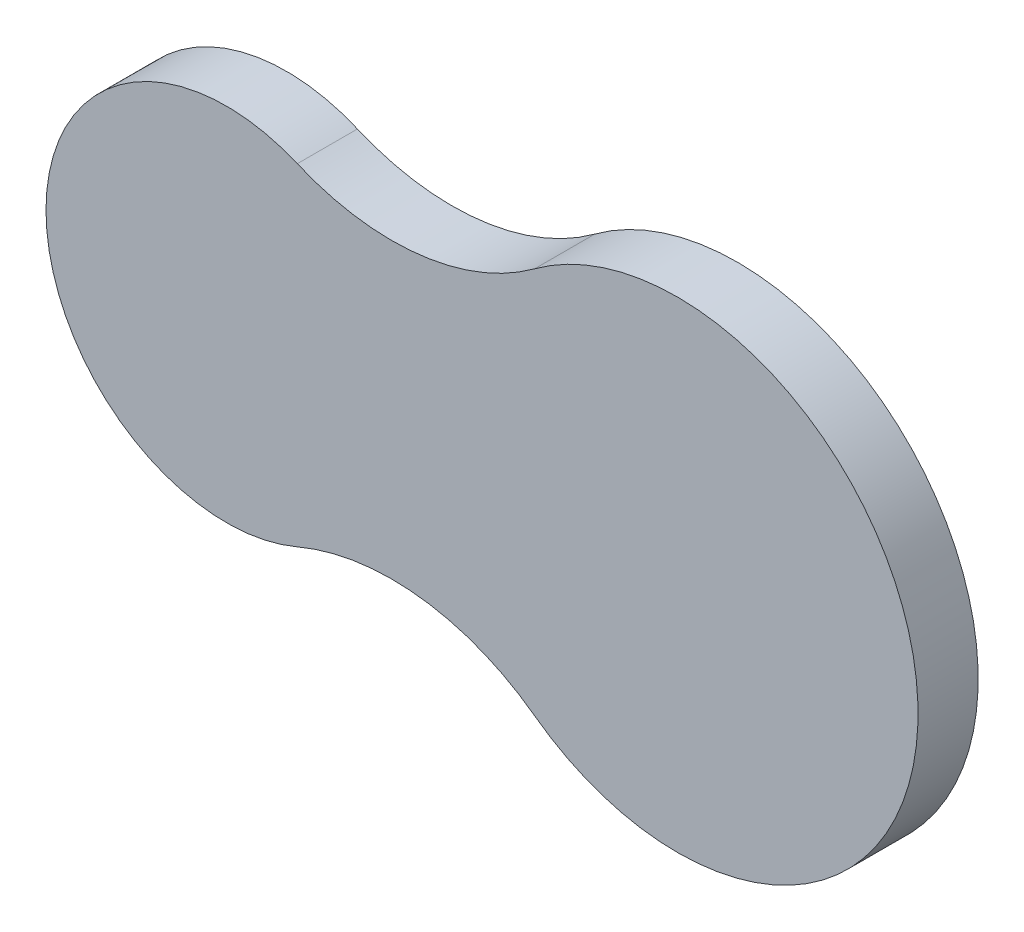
ISO-10303-21;
HEADER;
FILE_DESCRIPTION(('STEP AP214'),'2;1');
FILE_NAME('part.step','',(''),(''),'','','');
FILE_SCHEMA(('AUTOMOTIVE_DESIGN { 1 0 10303 214 1 1 1 1 }'));
ENDSEC;
DATA;
#1=APPLICATION_CONTEXT('core data for automotive mechanical design processes');
#2=APPLICATION_PROTOCOL_DEFINITION('international standard','automotive_design',2000,#1);
#3=PRODUCT_CONTEXT('',#1,'mechanical');
#4=PRODUCT('Part','Part','',(#3));
#5=PRODUCT_RELATED_PRODUCT_CATEGORY('part','',(#4));
#6=PRODUCT_DEFINITION_FORMATION('','',#4);
#7=PRODUCT_DEFINITION_CONTEXT('part definition',#1,'design');
#8=PRODUCT_DEFINITION('design','',#6,#7);
#9=PRODUCT_DEFINITION_SHAPE('','',#8);
#10=(LENGTH_UNIT() NAMED_UNIT(*) SI_UNIT(.MILLI.,.METRE.));
#11=(NAMED_UNIT(*) PLANE_ANGLE_UNIT() SI_UNIT($,.RADIAN.));
#12=(NAMED_UNIT(*) SI_UNIT($,.STERADIAN.) SOLID_ANGLE_UNIT());
#13=UNCERTAINTY_MEASURE_WITH_UNIT(LENGTH_MEASURE(1.E-05),#10,'distance_accuracy_value','');
#14=(GEOMETRIC_REPRESENTATION_CONTEXT(3) GLOBAL_UNCERTAINTY_ASSIGNED_CONTEXT((#13)) GLOBAL_UNIT_ASSIGNED_CONTEXT((#10,
#11,#12)) REPRESENTATION_CONTEXT('',''));
#15=CARTESIAN_POINT('',(0.,0.,0.));
#16=DIRECTION('',(0.,0.,1.));
#17=DIRECTION('',(1.,0.,0.));
#18=AXIS2_PLACEMENT_3D('',#15,#16,#17);
#19=CARTESIAN_POINT('',(27.5,64.3719659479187,10.));
#20=DIRECTION('',(0.,0.,-1.));
#21=DIRECTION('',(-1.,0.,0.));
#22=AXIS2_PLACEMENT_3D('',#19,#20,#21);
#23=CYLINDRICAL_SURFACE('',#22,40.);
#24=CARTESIAN_POINT('',(27.5,64.3719659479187,0.));
#25=DIRECTION('',(0.,0.,-1.));
#26=DIRECTION('',(1.,0.,0.));
#27=AXIS2_PLACEMENT_3D('',#24,#25,#26);
#28=CIRCLE('',#27,40.);
#29=CARTESIAN_POINT('',(51.25,32.1859829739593,0.));
#30=VERTEX_POINT('',#29);
#31=CARTESIAN_POINT('',(11.7857142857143,27.5879854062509,0.));
#32=VERTEX_POINT('',#31);
#33=EDGE_CURVE('E75',#30,#32,#28,.T.);
#34=ORIENTED_EDGE('',*,*,#33,.T.);
#35=DIRECTION('',(0.,0.,-1.));
#36=VECTOR('',#35,1.);
#37=CARTESIAN_POINT('',(11.7857142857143,27.5879854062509,10.));
#38=LINE('',#37,#36);
#39=CARTESIAN_POINT('',(11.7857142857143,27.5879854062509,10.));
#40=VERTEX_POINT('',#39);
#41=EDGE_CURVE('E11',#40,#32,#38,.T.);
#42=ORIENTED_EDGE('',*,*,#41,.F.);
#43=CARTESIAN_POINT('',(27.5,64.3719659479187,10.));
#44=DIRECTION('',(0.,0.,-1.));
#45=DIRECTION('',(1.,0.,0.));
#46=AXIS2_PLACEMENT_3D('',#43,#44,#45);
#47=CIRCLE('',#46,40.);
#48=CARTESIAN_POINT('',(51.25,32.1859829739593,10.));
#49=VERTEX_POINT('',#48);
#50=EDGE_CURVE('E93',#49,#40,#47,.T.);
#51=ORIENTED_EDGE('',*,*,#50,.F.);
#52=DIRECTION('',(0.,0.,-1.));
#53=VECTOR('',#52,1.);
#54=CARTESIAN_POINT('',(51.25,32.1859829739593,10.));
#55=LINE('',#54,#53);
#56=EDGE_CURVE('E87',#49,#30,#55,.T.);
#57=ORIENTED_EDGE('',*,*,#56,.T.);
#58=EDGE_LOOP('',(#34,#42,#51,#57));
#59=FACE_BOUND('',#58,.T.);
#60=ADVANCED_FACE('F31',(#59),#23,.F.);
#61=CARTESIAN_POINT('',(0.,0.,10.));
#62=DIRECTION('',(0.,0.,-1.));
#63=DIRECTION('',(-1.,0.,0.));
#64=AXIS2_PLACEMENT_3D('',#61,#62,#63);
#65=CYLINDRICAL_SURFACE('',#64,30.);
#66=CARTESIAN_POINT('',(0.,0.,0.));
#67=DIRECTION('',(0.,0.,1.));
#68=DIRECTION('',(1.,0.,0.));
#69=AXIS2_PLACEMENT_3D('',#66,#67,#68);
#70=CIRCLE('',#69,30.);
#71=CARTESIAN_POINT('',(11.7857142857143,-27.5879854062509,0.));
#72=VERTEX_POINT('',#71);
#73=EDGE_CURVE('E71',#32,#72,#70,.T.);
#74=ORIENTED_EDGE('',*,*,#73,.T.);
#75=DIRECTION('',(0.,0.,-1.));
#76=VECTOR('',#75,1.);
#77=CARTESIAN_POINT('',(11.7857142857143,-27.5879854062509,10.));
#78=LINE('',#77,#76);
#79=CARTESIAN_POINT('',(11.7857142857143,-27.5879854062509,10.));
#80=VERTEX_POINT('',#79);
#81=EDGE_CURVE('E38',#80,#72,#78,.T.);
#82=ORIENTED_EDGE('',*,*,#81,.F.);
#83=CARTESIAN_POINT('',(0.,0.,10.));
#84=DIRECTION('',(0.,0.,1.));
#85=DIRECTION('',(1.,0.,0.));
#86=AXIS2_PLACEMENT_3D('',#83,#84,#85);
#87=CIRCLE('',#86,30.);
#88=EDGE_CURVE('E83',#40,#80,#87,.T.);
#89=ORIENTED_EDGE('',*,*,#88,.F.);
#90=ORIENTED_EDGE('',*,*,#41,.T.);
#91=EDGE_LOOP('',(#74,#82,#89,#90));
#92=FACE_BOUND('',#91,.T.);
#93=ADVANCED_FACE('F82',(#92),#65,.T.);
#94=CARTESIAN_POINT('',(27.5,-64.3719659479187,10.));
#95=DIRECTION('',(0.,0.,-1.));
#96=DIRECTION('',(-1.,0.,0.));
#97=AXIS2_PLACEMENT_3D('',#94,#95,#96);
#98=CYLINDRICAL_SURFACE('',#97,40.);
#99=CARTESIAN_POINT('',(27.5,-64.3719659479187,0.));
#100=DIRECTION('',(0.,0.,-1.));
#101=DIRECTION('',(1.,0.,0.));
#102=AXIS2_PLACEMENT_3D('',#99,#100,#101);
#103=CIRCLE('',#102,40.);
#104=CARTESIAN_POINT('',(51.25,-32.1859829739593,0.));
#105=VERTEX_POINT('',#104);
#106=EDGE_CURVE('E76',#72,#105,#103,.T.);
#107=ORIENTED_EDGE('',*,*,#106,.T.);
#108=DIRECTION('',(0.,0.,-1.));
#109=VECTOR('',#108,1.);
#110=CARTESIAN_POINT('',(51.25,-32.1859829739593,10.));
#111=LINE('',#110,#109);
#112=CARTESIAN_POINT('',(51.25,-32.1859829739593,10.));
#113=VERTEX_POINT('',#112);
#114=EDGE_CURVE('E99',#113,#105,#111,.T.);
#115=ORIENTED_EDGE('',*,*,#114,.F.);
#116=CARTESIAN_POINT('',(27.5,-64.3719659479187,10.));
#117=DIRECTION('',(0.,0.,-1.));
#118=DIRECTION('',(1.,0.,0.));
#119=AXIS2_PLACEMENT_3D('',#116,#117,#118);
#120=CIRCLE('',#119,40.);
#121=EDGE_CURVE('E50',#80,#113,#120,.T.);
#122=ORIENTED_EDGE('',*,*,#121,.F.);
#123=ORIENTED_EDGE('',*,*,#81,.T.);
#124=EDGE_LOOP('',(#107,#115,#122,#123));
#125=FACE_BOUND('',#124,.T.);
#126=ADVANCED_FACE('F102',(#125),#98,.F.);
#127=CARTESIAN_POINT('',(75.,0.,10.));
#128=DIRECTION('',(0.,0.,-1.));
#129=DIRECTION('',(-1.,0.,0.));
#130=AXIS2_PLACEMENT_3D('',#127,#128,#129);
#131=CYLINDRICAL_SURFACE('',#130,40.);
#132=CARTESIAN_POINT('',(75.,0.,0.));
#133=DIRECTION('',(0.,0.,1.));
#134=DIRECTION('',(-1.,0.,0.));
#135=AXIS2_PLACEMENT_3D('',#132,#133,#134);
#136=CIRCLE('',#135,40.);
#137=EDGE_CURVE('E91',#105,#30,#136,.T.);
#138=ORIENTED_EDGE('',*,*,#137,.T.);
#139=ORIENTED_EDGE('',*,*,#56,.F.);
#140=CARTESIAN_POINT('',(75.,0.,10.));
#141=DIRECTION('',(0.,0.,1.));
#142=DIRECTION('',(-1.,0.,0.));
#143=AXIS2_PLACEMENT_3D('',#140,#141,#142);
#144=CIRCLE('',#143,40.);
#145=EDGE_CURVE('E45',#113,#49,#144,.T.);
#146=ORIENTED_EDGE('',*,*,#145,.F.);
#147=ORIENTED_EDGE('',*,*,#114,.T.);
#148=EDGE_LOOP('',(#138,#139,#146,#147));
#149=FACE_BOUND('',#148,.T.);
#150=ADVANCED_FACE('F104',(#149),#131,.T.);
#151=CARTESIAN_POINT('',(51.25,32.1859829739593,10.));
#152=DIRECTION('',(0.,0.,1.));
#153=DIRECTION('',(1.,0.,0.));
#154=AXIS2_PLACEMENT_3D('',#151,#152,#153);
#155=PLANE('',#154);
#156=ORIENTED_EDGE('',*,*,#50,.T.);
#157=ORIENTED_EDGE('',*,*,#88,.T.);
#158=ORIENTED_EDGE('',*,*,#121,.T.);
#159=ORIENTED_EDGE('',*,*,#145,.T.);
#160=EDGE_LOOP('',(#156,#157,#158,#159));
#161=FACE_BOUND('',#160,.T.);
#162=ADVANCED_FACE('F105',(#161),#155,.T.);
#163=CARTESIAN_POINT('',(51.25,32.1859829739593,0.));
#164=DIRECTION('',(0.,0.,1.));
#165=DIRECTION('',(1.,0.,0.));
#166=AXIS2_PLACEMENT_3D('',#163,#164,#165);
#167=PLANE('',#166);
#168=ORIENTED_EDGE('',*,*,#33,.F.);
#169=ORIENTED_EDGE('',*,*,#137,.F.);
#170=ORIENTED_EDGE('',*,*,#106,.F.);
#171=ORIENTED_EDGE('',*,*,#73,.F.);
#172=EDGE_LOOP('',(#168,#169,#170,#171));
#173=FACE_BOUND('',#172,.T.);
#174=ADVANCED_FACE('F72',(#173),#167,.F.);
#175=CLOSED_SHELL('',(#60,#93,#126,#150,#162,#174));
#176=MANIFOLD_SOLID_BREP('B2',#175);
#177=ADVANCED_BREP_SHAPE_REPRESENTATION('',(#18,#176),#14);
#178=SHAPE_DEFINITION_REPRESENTATION(#9,#177);
ENDSEC;
END-ISO-10303-21;
